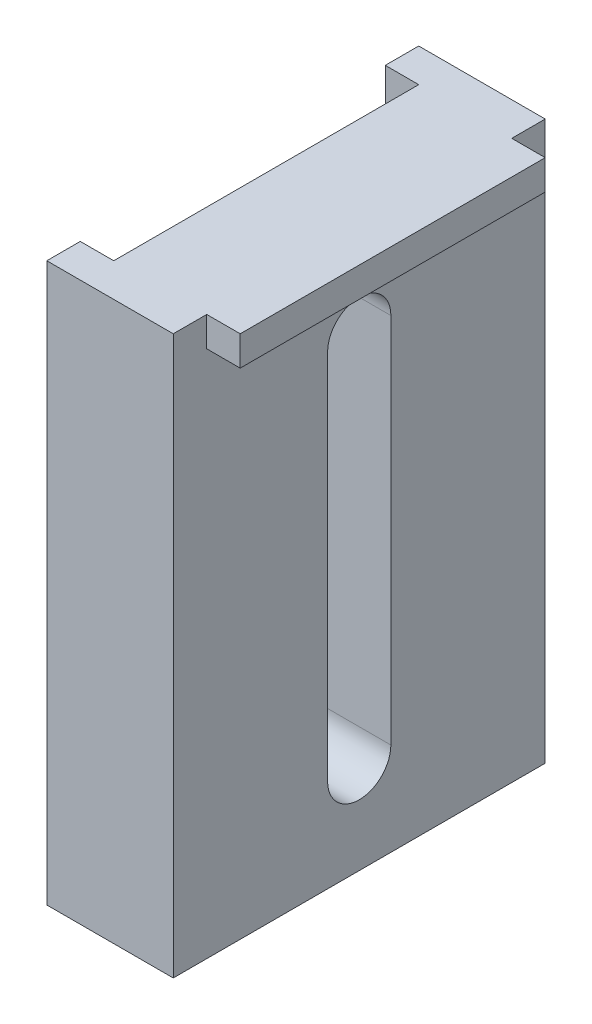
from build123d import *

# Parameters (mm, degrees)
EXTRUSION1_DEPTH        = 25
ESQUISSE2_W             = 41
ESQUISSE2_H             = 71
ENL_V_MAT_EXTRU_1_DEPTH = 2
ESQUISSE3_W             = 41
ESQUISSE3_H             = 4
ENL_V_MAT_EXTRU_2_DEPTH = 4.5
LUMIERE1_REACH          = 180.339
ESQUISSE4_W             = 4.5
ESQUISSE4_H             = 4.5
ENL_V_MAT_EXTRU_4_DEPTH = 78.168646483


with BuildPart() as part:
    # Esquisse1 → Extrusion1 (new, symmetric)
    with BuildSketch(Plane.XY):
        Polygon((0, 0), (0, 71), (4.5, 71), (4.5, 75), (-17, 75), (-17, 0), align=None)
    extrude(amount=EXTRUSION1_DEPTH, both=True)

    # Esquisse2 → Enl_v. mat.-Extru.1 (cut)
    with BuildSketch(Plane.ZY.offset(17)):
        with Locations((0, 35.5)):
            Rectangle(ESQUISSE2_W, ESQUISSE2_H)
    extrude(amount=-ENL_V_MAT_EXTRU_1_DEPTH, mode=Mode.SUBTRACT)

    # Esquisse3 → Enl_v. mat.-Extru.2 (cut)
    with BuildSketch(Plane.ZY.offset(17)):
        with Locations((0, 73)):
            Rectangle(ESQUISSE3_W, ESQUISSE3_H)
    extrude(amount=-ENL_V_MAT_EXTRU_2_DEPTH, mode=Mode.SUBTRACT)

    # Sketch2 → lumiere1 (cut, up to next)
    with BuildSketch(Plane(origin=(-15, -52.800267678, -97.848400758), x_dir=(0, 0, 1), z_dir=(-1, 0, 0)), mode=Mode.PRIVATE) as lumiere1_sk1:
        with BuildLine():
            Line((93.598400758, 115.300267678), (93.598400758, 65.300267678))
            ThreePointArc((93.598400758, 65.300267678), (97.848400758, 61.050267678), (102.098400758, 65.300267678))
            Line((102.098400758, 65.300267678), (102.098400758, 115.300267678))
            ThreePointArc((102.098400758, 115.300267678), (97.848400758, 119.550267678), (93.598400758, 115.300267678))
        make_face()
    lumiere1_tool1 = extrude(lumiere1_sk1.sketch, amount=-LUMIERE1_REACH, mode=Mode.PRIVATE) & part.part
    add(lumiere1_tool1.solids().sort_by_distance((-15, 37.5, 0))[0], mode=Mode.SUBTRACT)

    # Esquisse4 → Enl_v. mat.-Extru.4 (cut, through all)
    with BuildSketch(Plane.XZ.offset(-71)):
        with Locations((2.25, -22.75)):
            Rectangle(ESQUISSE4_W, ESQUISSE4_H)
        with Locations((2.25, 22.75)):
            Rectangle(ESQUISSE4_W, ESQUISSE4_H)
    extrude(amount=-ENL_V_MAT_EXTRU_4_DEPTH, mode=Mode.SUBTRACT)


solid = part.part
